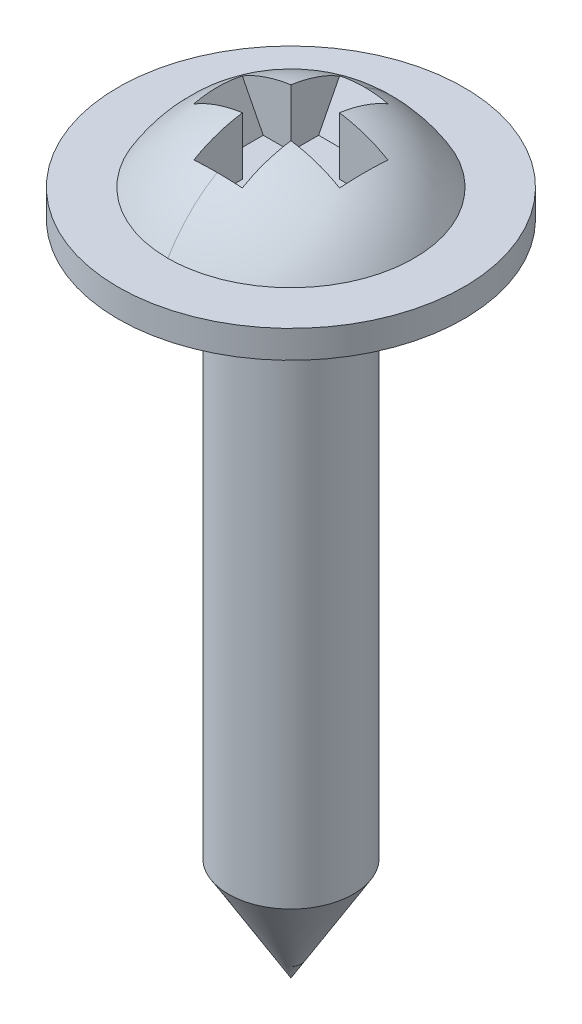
ISO-10303-21;
HEADER;
FILE_DESCRIPTION(('STEP AP214'),'2;1');
FILE_NAME('part.step','',(''),(''),'','','');
FILE_SCHEMA(('AUTOMOTIVE_DESIGN { 1 0 10303 214 1 1 1 1 }'));
ENDSEC;
DATA;
#1=APPLICATION_CONTEXT('core data for automotive mechanical design processes');
#2=APPLICATION_PROTOCOL_DEFINITION('international standard','automotive_design',2000,#1);
#3=PRODUCT_CONTEXT('',#1,'mechanical');
#4=PRODUCT('Part','Part','',(#3));
#5=PRODUCT_RELATED_PRODUCT_CATEGORY('part','',(#4));
#6=PRODUCT_DEFINITION_FORMATION('','',#4);
#7=PRODUCT_DEFINITION_CONTEXT('part definition',#1,'design');
#8=PRODUCT_DEFINITION('design','',#6,#7);
#9=PRODUCT_DEFINITION_SHAPE('','',#8);
#10=(LENGTH_UNIT() NAMED_UNIT(*) SI_UNIT(.MILLI.,.METRE.));
#11=(NAMED_UNIT(*) PLANE_ANGLE_UNIT() SI_UNIT($,.RADIAN.));
#12=(NAMED_UNIT(*) SI_UNIT($,.STERADIAN.) SOLID_ANGLE_UNIT());
#13=UNCERTAINTY_MEASURE_WITH_UNIT(LENGTH_MEASURE(1.E-05),#10,'distance_accuracy_value','');
#14=(GEOMETRIC_REPRESENTATION_CONTEXT(3) GLOBAL_UNCERTAINTY_ASSIGNED_CONTEXT((#13)) GLOBAL_UNIT_ASSIGNED_CONTEXT((#10,
#11,#12)) REPRESENTATION_CONTEXT('',''));
#15=CARTESIAN_POINT('',(0.,0.,0.));
#16=DIRECTION('',(0.,0.,1.));
#17=DIRECTION('',(1.,0.,0.));
#18=AXIS2_PLACEMENT_3D('',#15,#16,#17);
#19=CARTESIAN_POINT('',(-0.75,0.5,-0.35));
#20=DIRECTION('',(0.,-1.,0.));
#21=DIRECTION('',(0.,0.,-1.));
#22=AXIS2_PLACEMENT_3D('',#19,#20,#21);
#23=PLANE('',#22);
#24=DIRECTION('',(0.,0.,-1.));
#25=VECTOR('',#24,1.);
#26=CARTESIAN_POINT('',(0.35,0.5,0.));
#27=LINE('',#26,#25);
#28=CARTESIAN_POINT('',(0.349999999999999,0.5,-0.35));
#29=VERTEX_POINT('',#28);
#30=CARTESIAN_POINT('',(0.349999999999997,0.5,-0.750000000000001));
#31=VERTEX_POINT('',#30);
#32=EDGE_CURVE('E293',#29,#31,#27,.T.);
#33=ORIENTED_EDGE('',*,*,#32,.T.);
#34=DIRECTION('',(1.,0.,0.));
#35=VECTOR('',#34,1.);
#36=CARTESIAN_POINT('',(-0.350000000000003,0.500000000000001,-0.749999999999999));
#37=LINE('',#36,#35);
#38=CARTESIAN_POINT('',(-0.350000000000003,0.500000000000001,-0.749999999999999));
#39=VERTEX_POINT('',#38);
#40=EDGE_CURVE('E304',#31,#39,#37,.F.);
#41=ORIENTED_EDGE('',*,*,#40,.T.);
#42=DIRECTION('',(0.,0.,-1.));
#43=VECTOR('',#42,1.);
#44=CARTESIAN_POINT('',(-0.35,0.5,0.));
#45=LINE('',#44,#43);
#46=CARTESIAN_POINT('',(-0.350000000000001,0.5,-0.35));
#47=VERTEX_POINT('',#46);
#48=EDGE_CURVE('E328',#47,#39,#45,.T.);
#49=ORIENTED_EDGE('',*,*,#48,.F.);
#50=DIRECTION('',(1.,0.,0.));
#51=VECTOR('',#50,1.);
#52=CARTESIAN_POINT('',(0.,0.5,-0.35));
#53=LINE('',#52,#51);
#54=CARTESIAN_POINT('',(-0.75,0.5,-0.35));
#55=VERTEX_POINT('',#54);
#56=EDGE_CURVE('E323',#55,#47,#53,.T.);
#57=ORIENTED_EDGE('',*,*,#56,.F.);
#58=DIRECTION('',(0.,0.,1.));
#59=VECTOR('',#58,1.);
#60=CARTESIAN_POINT('',(-0.75,0.5,-0.35));
#61=LINE('',#60,#59);
#62=CARTESIAN_POINT('',(-0.75,0.5,0.35));
#63=VERTEX_POINT('',#62);
#64=EDGE_CURVE('E318',#55,#63,#61,.T.);
#65=ORIENTED_EDGE('',*,*,#64,.T.);
#66=DIRECTION('',(1.,0.,0.));
#67=VECTOR('',#66,1.);
#68=CARTESIAN_POINT('',(0.,0.5,0.35));
#69=LINE('',#68,#67);
#70=CARTESIAN_POINT('',(-0.349999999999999,0.5,0.35));
#71=VERTEX_POINT('',#70);
#72=EDGE_CURVE('E310',#63,#71,#69,.T.);
#73=ORIENTED_EDGE('',*,*,#72,.T.);
#74=DIRECTION('',(0.,0.,-1.));
#75=VECTOR('',#74,1.);
#76=CARTESIAN_POINT('',(-0.35,0.5,0.));
#77=LINE('',#76,#75);
#78=CARTESIAN_POINT('',(-0.349999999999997,0.5,0.750000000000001));
#79=VERTEX_POINT('',#78);
#80=EDGE_CURVE('E307',#79,#71,#77,.T.);
#81=ORIENTED_EDGE('',*,*,#80,.F.);
#82=DIRECTION('',(1.,0.,0.));
#83=VECTOR('',#82,1.);
#84=CARTESIAN_POINT('',(-0.349999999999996,0.5,0.750000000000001));
#85=LINE('',#84,#83);
#86=CARTESIAN_POINT('',(0.350000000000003,0.500000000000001,0.749999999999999));
#87=VERTEX_POINT('',#86);
#88=EDGE_CURVE('E301',#79,#87,#85,.T.);
#89=ORIENTED_EDGE('',*,*,#88,.T.);
#90=DIRECTION('',(0.,0.,-1.));
#91=VECTOR('',#90,1.);
#92=CARTESIAN_POINT('',(0.35,0.5,0.));
#93=LINE('',#92,#91);
#94=CARTESIAN_POINT('',(0.350000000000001,0.5,0.35));
#95=VERTEX_POINT('',#94);
#96=EDGE_CURVE('E289',#87,#95,#93,.T.);
#97=ORIENTED_EDGE('',*,*,#96,.T.);
#98=DIRECTION('',(1.,0.,0.));
#99=VECTOR('',#98,1.);
#100=CARTESIAN_POINT('',(0.,0.5,0.35));
#101=LINE('',#100,#99);
#102=CARTESIAN_POINT('',(0.75,0.5,0.35));
#103=VERTEX_POINT('',#102);
#104=EDGE_CURVE('E286',#95,#103,#101,.T.);
#105=ORIENTED_EDGE('',*,*,#104,.T.);
#106=DIRECTION('',(0.,0.,1.));
#107=VECTOR('',#106,1.);
#108=CARTESIAN_POINT('',(0.75,0.5,-0.35));
#109=LINE('',#108,#107);
#110=CARTESIAN_POINT('',(0.75,0.5,-0.35));
#111=VERTEX_POINT('',#110);
#112=EDGE_CURVE('E278',#103,#111,#109,.F.);
#113=ORIENTED_EDGE('',*,*,#112,.T.);
#114=DIRECTION('',(1.,0.,0.));
#115=VECTOR('',#114,1.);
#116=CARTESIAN_POINT('',(0.,0.5,-0.35));
#117=LINE('',#116,#115);
#118=EDGE_CURVE('E275',#29,#111,#117,.T.);
#119=ORIENTED_EDGE('',*,*,#118,.F.);
#120=EDGE_LOOP('',(#33,#41,#49,#57,#65,#73,#81,#89,#97,#105,#113,#119));
#121=FACE_BOUND('',#120,.T.);
#122=ADVANCED_FACE('F14',(#121),#23,.F.);
#123=CARTESIAN_POINT('',(0.35,0.,0.));
#124=DIRECTION('',(1.,0.,0.));
#125=DIRECTION('',(0.,0.,-1.));
#126=AXIS2_PLACEMENT_3D('',#123,#124,#125);
#127=PLANE('',#126);
#128=DIRECTION('',(0.,0.889836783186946,-0.456278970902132));
#129=VECTOR('',#128,1.);
#130=CARTESIAN_POINT('',(0.349999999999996,0.499999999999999,-0.750000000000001));
#131=LINE('',#130,#129);
#132=CARTESIAN_POINT('',(0.349999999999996,1.09190233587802,-1.0535080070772));
#133=VERTEX_POINT('',#132);
#134=EDGE_CURVE('E124',#133,#31,#131,.F.);
#135=ORIENTED_EDGE('',*,*,#134,.T.);
#136=ORIENTED_EDGE('',*,*,#32,.F.);
#137=DIRECTION('',(0.,1.,0.));
#138=VECTOR('',#137,1.);
#139=CARTESIAN_POINT('',(0.349999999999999,0.,-0.35));
#140=LINE('',#139,#138);
#141=CARTESIAN_POINT('',(0.349999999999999,1.3319267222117,-0.35));
#142=VERTEX_POINT('',#141);
#143=EDGE_CURVE('E279',#142,#29,#140,.F.);
#144=ORIENTED_EDGE('',*,*,#143,.F.);
#145=CARTESIAN_POINT('',(0.349999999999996,1.09190233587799,-1.05350800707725));
#146=CARTESIAN_POINT('',(0.349999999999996,1.10772814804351,-1.02635544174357));
#147=CARTESIAN_POINT('',(0.349999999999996,1.12283813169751,-0.998787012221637));
#148=CARTESIAN_POINT('',(0.349999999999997,1.15150266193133,-0.943103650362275));
#149=CARTESIAN_POINT('',(0.349999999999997,1.1650676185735,-0.914994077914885));
#150=CARTESIAN_POINT('',(0.349999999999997,1.19068784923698,-0.858250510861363));
#151=CARTESIAN_POINT('',(0.349999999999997,1.20274974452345,-0.829619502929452));
#152=CARTESIAN_POINT('',(0.349999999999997,1.22541219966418,-0.771855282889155));
#153=CARTESIAN_POINT('',(0.349999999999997,1.23601579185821,-0.742723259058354));
#154=CARTESIAN_POINT('',(0.349999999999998,1.25580007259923,-0.683997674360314));
#155=CARTESIAN_POINT('',(0.349999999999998,1.26498149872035,-0.654404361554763));
#156=CARTESIAN_POINT('',(0.349999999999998,1.28197609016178,-0.594747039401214));
#157=CARTESIAN_POINT('',(0.349999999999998,1.28978572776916,-0.564682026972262));
#158=CARTESIAN_POINT('',(0.349999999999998,1.3040780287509,-0.504091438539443));
#159=CARTESIAN_POINT('',(0.349999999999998,1.31055433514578,-0.473564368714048));
#160=CARTESIAN_POINT('',(0.349999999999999,1.32221812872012,-0.412056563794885));
#161=CARTESIAN_POINT('',(0.349999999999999,1.32739686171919,-0.381074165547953));
#162=CARTESIAN_POINT('',(0.349999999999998,1.3319267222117,-0.350000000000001));
#163=B_SPLINE_CURVE_WITH_KNOTS('',3,(#145,#146,#147,#148,#149,#150,#151,#152,#153,#154,#155,
#156,#157,#158,#159,#160,#161,#162),.UNSPECIFIED.,.F.,.F.,(4,2,2,2,2,2,2,2,4),(0.,
0.0942713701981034,0.187864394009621,0.281029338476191,0.37399753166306,0.466917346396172,
0.560072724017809,0.653662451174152,0.747867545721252),.UNSPECIFIED.);
#164=EDGE_CURVE('E128',#133,#142,#163,.T.);
#165=ORIENTED_EDGE('',*,*,#164,.F.);
#166=EDGE_LOOP('',(#135,#136,#144,#165));
#167=FACE_BOUND('',#166,.T.);
#168=ADVANCED_FACE('F416',(#167),#127,.F.);
#169=CARTESIAN_POINT('',(0.,0.,-0.35));
#170=DIRECTION('',(0.,0.,1.));
#171=DIRECTION('',(1.,0.,0.));
#172=AXIS2_PLACEMENT_3D('',#169,#170,#171);
#173=PLANE('',#172);
#174=DIRECTION('',(0.456278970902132,0.889836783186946,0.));
#175=VECTOR('',#174,1.);
#176=CARTESIAN_POINT('',(0.75,0.5,-0.35));
#177=LINE('',#176,#175);
#178=CARTESIAN_POINT('',(1.05350800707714,1.09190233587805,-0.35));
#179=VERTEX_POINT('',#178);
#180=EDGE_CURVE('E283',#111,#179,#177,.T.);
#181=ORIENTED_EDGE('',*,*,#180,.T.);
#182=CARTESIAN_POINT('',(0.35,1.3319267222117,-0.35));
#183=CARTESIAN_POINT('',(0.381074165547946,1.32739686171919,-0.35));
#184=CARTESIAN_POINT('',(0.412056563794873,1.32221812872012,-0.35));
#185=CARTESIAN_POINT('',(0.473564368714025,1.31055433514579,-0.35));
#186=CARTESIAN_POINT('',(0.504091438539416,1.3040780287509,-0.35));
#187=CARTESIAN_POINT('',(0.564682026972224,1.28978572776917,-0.35));
#188=CARTESIAN_POINT('',(0.594747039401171,1.28197609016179,-0.35));
#189=CARTESIAN_POINT('',(0.65440436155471,1.26498149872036,-0.35));
#190=CARTESIAN_POINT('',(0.683997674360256,1.25580007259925,-0.35));
#191=CARTESIAN_POINT('',(0.742723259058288,1.23601579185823,-0.35));
#192=CARTESIAN_POINT('',(0.771855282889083,1.22541219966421,-0.35));
#193=CARTESIAN_POINT('',(0.829619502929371,1.20274974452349,-0.35));
#194=CARTESIAN_POINT('',(0.858250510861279,1.19068784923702,-0.35));
#195=CARTESIAN_POINT('',(0.914994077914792,1.16506761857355,-0.35));
#196=CARTESIAN_POINT('',(0.943103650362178,1.15150266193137,-0.35));
#197=CARTESIAN_POINT('',(0.998787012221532,1.12283813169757,-0.35));
#198=CARTESIAN_POINT('',(1.02635544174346,1.10772814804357,-0.35));
#199=CARTESIAN_POINT('',(1.05350800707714,1.09190233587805,-0.35));
#200=B_SPLINE_CURVE_WITH_KNOTS('',3,(#182,#183,#184,#185,#186,#187,#188,#189,#190,#191,#192,
#193,#194,#195,#196,#197,#198,#199),.UNSPECIFIED.,.F.,.F.,(4,2,2,2,2,2,2,2,4),(0.,
0.0942050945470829,0.187794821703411,0.280950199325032,0.373870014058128,0.466838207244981,
0.560003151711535,0.653596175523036,0.747867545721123),.UNSPECIFIED.);
#201=EDGE_CURVE('E419',#142,#179,#200,.T.);
#202=ORIENTED_EDGE('',*,*,#201,.F.);
#203=ORIENTED_EDGE('',*,*,#143,.T.);
#204=ORIENTED_EDGE('',*,*,#118,.T.);
#205=EDGE_LOOP('',(#181,#202,#203,#204));
#206=FACE_BOUND('',#205,.T.);
#207=ADVANCED_FACE('F432',(#206),#173,.T.);
#208=CARTESIAN_POINT('',(0.75,0.5,-0.35));
#209=DIRECTION('',(0.889836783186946,-0.456278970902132,0.));
#210=DIRECTION('',(0.456278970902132,0.889836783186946,0.));
#211=AXIS2_PLACEMENT_3D('',#208,#209,#210);
#212=PLANE('',#211);
#213=ORIENTED_EDGE('',*,*,#180,.F.);
#214=ORIENTED_EDGE('',*,*,#112,.F.);
#215=DIRECTION('',(0.456278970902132,0.889836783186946,0.));
#216=VECTOR('',#215,1.);
#217=CARTESIAN_POINT('',(0.75,0.5,0.35));
#218=LINE('',#217,#216);
#219=CARTESIAN_POINT('',(1.05350800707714,1.09190233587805,0.35));
#220=VERTEX_POINT('',#219);
#221=EDGE_CURVE('E290',#103,#220,#218,.T.);
#222=ORIENTED_EDGE('',*,*,#221,.T.);
#223=CARTESIAN_POINT('',(1.05350800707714,1.09190233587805,-0.35));
#224=CARTESIAN_POINT('',(1.0557298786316,1.09623543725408,-0.320929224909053));
#225=CARTESIAN_POINT('',(1.05767113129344,1.10002127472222,-0.291755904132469));
#226=CARTESIAN_POINT('',(1.06098527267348,1.10648452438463,-0.233406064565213));
#227=CARTESIAN_POINT('',(1.06236101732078,1.10916750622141,-0.204230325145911));
#228=CARTESIAN_POINT('',(1.06455597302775,1.11344811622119,-0.145878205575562));
#229=CARTESIAN_POINT('',(1.06537705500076,1.11504939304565,-0.11670216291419));
#230=CARTESIAN_POINT('',(1.06647015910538,1.11718116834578,-0.0583506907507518));
#231=CARTESIAN_POINT('',(1.06674311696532,1.117713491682,-0.0291753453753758));
#232=CARTESIAN_POINT('',(1.06674311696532,1.117713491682,0.0291753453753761));
#233=CARTESIAN_POINT('',(1.06647015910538,1.11718116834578,0.058350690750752));
#234=CARTESIAN_POINT('',(1.06537705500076,1.11504939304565,0.11670216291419));
#235=CARTESIAN_POINT('',(1.06455597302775,1.11344811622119,0.145878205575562));
#236=CARTESIAN_POINT('',(1.06236101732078,1.10916750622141,0.204230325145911));
#237=CARTESIAN_POINT('',(1.06098527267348,1.10648452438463,0.233406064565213));
#238=CARTESIAN_POINT('',(1.05767113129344,1.10002127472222,0.29175590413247));
#239=CARTESIAN_POINT('',(1.0557298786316,1.09623543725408,0.320929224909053));
#240=CARTESIAN_POINT('',(1.05350800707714,1.09190233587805,0.35));
#241=B_SPLINE_CURVE_WITH_KNOTS('',3,(#223,#224,#225,#226,#227,#228,#229,#230,#231,#232,#233,
#234,#235,#236,#237,#238,#239,#240),.UNSPECIFIED.,.F.,.F.,(4,2,2,2,2,2,2,2,4),(0.,
0.0884201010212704,0.176388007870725,0.264057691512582,0.351577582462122,0.439097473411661,
0.526767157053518,0.614735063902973,0.703155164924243),.UNSPECIFIED.);
#242=EDGE_CURVE('E420',#179,#220,#241,.T.);
#243=ORIENTED_EDGE('',*,*,#242,.F.);
#244=EDGE_LOOP('',(#213,#214,#222,#243));
#245=FACE_BOUND('',#244,.T.);
#246=ADVANCED_FACE('F436',(#245),#212,.F.);
#247=CARTESIAN_POINT('',(0.,0.,0.35));
#248=DIRECTION('',(0.,0.,1.));
#249=DIRECTION('',(1.,0.,0.));
#250=AXIS2_PLACEMENT_3D('',#247,#248,#249);
#251=PLANE('',#250);
#252=DIRECTION('',(0.,1.,0.));
#253=VECTOR('',#252,1.);
#254=CARTESIAN_POINT('',(0.350000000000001,0.,0.35));
#255=LINE('',#254,#253);
#256=CARTESIAN_POINT('',(0.350000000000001,1.3319267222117,0.350000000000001));
#257=VERTEX_POINT('',#256);
#258=EDGE_CURVE('E298',#95,#257,#255,.T.);
#259=ORIENTED_EDGE('',*,*,#258,.T.);
#260=CARTESIAN_POINT('',(1.05350800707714,1.09190233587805,0.35));
#261=CARTESIAN_POINT('',(1.02635544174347,1.10772814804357,0.35));
#262=CARTESIAN_POINT('',(0.998787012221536,1.12283813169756,0.35));
#263=CARTESIAN_POINT('',(0.943103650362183,1.15150266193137,0.35));
#264=CARTESIAN_POINT('',(0.914994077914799,1.16506761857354,0.35));
#265=CARTESIAN_POINT('',(0.858250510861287,1.19068784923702,0.35));
#266=CARTESIAN_POINT('',(0.829619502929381,1.20274974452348,0.35));
#267=CARTESIAN_POINT('',(0.771855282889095,1.22541219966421,0.35));
#268=CARTESIAN_POINT('',(0.7427232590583,1.23601579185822,0.35));
#269=CARTESIAN_POINT('',(0.683997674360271,1.25580007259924,0.35));
#270=CARTESIAN_POINT('',(0.654404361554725,1.26498149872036,0.35));
#271=CARTESIAN_POINT('',(0.594747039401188,1.28197609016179,0.35));
#272=CARTESIAN_POINT('',(0.564682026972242,1.28978572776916,0.35));
#273=CARTESIAN_POINT('',(0.504091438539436,1.3040780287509,0.35));
#274=CARTESIAN_POINT('',(0.473564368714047,1.31055433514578,0.35));
#275=CARTESIAN_POINT('',(0.412056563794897,1.32221812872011,0.35));
#276=CARTESIAN_POINT('',(0.381074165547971,1.32739686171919,0.35));
#277=CARTESIAN_POINT('',(0.350000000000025,1.3319267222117,0.35));
#278=B_SPLINE_CURVE_WITH_KNOTS('',3,(#260,#261,#262,#263,#264,#265,#266,#267,#268,#269,#270,
#271,#272,#273,#274,#275,#276,#277),.UNSPECIFIED.,.F.,.F.,(4,2,2,2,2,2,2,2,4),(0.,
0.0942713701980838,0.187864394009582,0.281029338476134,0.373997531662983,0.466917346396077,
0.560072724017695,0.653662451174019,0.747867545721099),.UNSPECIFIED.);
#279=EDGE_CURVE('E449',#220,#257,#278,.T.);
#280=ORIENTED_EDGE('',*,*,#279,.F.);
#281=ORIENTED_EDGE('',*,*,#221,.F.);
#282=ORIENTED_EDGE('',*,*,#104,.F.);
#283=EDGE_LOOP('',(#259,#280,#281,#282));
#284=FACE_BOUND('',#283,.T.);
#285=ADVANCED_FACE('F441',(#284),#251,.F.);
#286=CARTESIAN_POINT('',(0.35,0.,0.));
#287=DIRECTION('',(1.,0.,0.));
#288=DIRECTION('',(0.,0.,-1.));
#289=AXIS2_PLACEMENT_3D('',#286,#287,#288);
#290=PLANE('',#289);
#291=ORIENTED_EDGE('',*,*,#258,.F.);
#292=ORIENTED_EDGE('',*,*,#96,.F.);
#293=DIRECTION('',(0.,-0.889836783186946,-0.456278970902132));
#294=VECTOR('',#293,1.);
#295=CARTESIAN_POINT('',(0.350000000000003,1.47510168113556,1.25));
#296=LINE('',#295,#294);
#297=CARTESIAN_POINT('',(0.350000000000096,1.09190233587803,1.05350800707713));
#298=VERTEX_POINT('',#297);
#299=EDGE_CURVE('E303',#87,#298,#296,.F.);
#300=ORIENTED_EDGE('',*,*,#299,.T.);
#301=CARTESIAN_POINT('',(0.350000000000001,1.3319267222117,0.350000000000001));
#302=CARTESIAN_POINT('',(0.350000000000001,1.32739686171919,0.381074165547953));
#303=CARTESIAN_POINT('',(0.350000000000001,1.32221812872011,0.412056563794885));
#304=CARTESIAN_POINT('',(0.350000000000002,1.31055433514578,0.473564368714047));
#305=CARTESIAN_POINT('',(0.350000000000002,1.3040780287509,0.504091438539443));
#306=CARTESIAN_POINT('',(0.350000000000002,1.28978572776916,0.564682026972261));
#307=CARTESIAN_POINT('',(0.350000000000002,1.28197609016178,0.594747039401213));
#308=CARTESIAN_POINT('',(0.350000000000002,1.26498149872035,0.654404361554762));
#309=CARTESIAN_POINT('',(0.350000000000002,1.25580007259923,0.683997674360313));
#310=CARTESIAN_POINT('',(0.350000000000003,1.23601579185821,0.742723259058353));
#311=CARTESIAN_POINT('',(0.350000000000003,1.22541219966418,0.771855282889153));
#312=CARTESIAN_POINT('',(0.350000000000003,1.20274974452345,0.829619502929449));
#313=CARTESIAN_POINT('',(0.350000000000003,1.19068784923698,0.858250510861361));
#314=CARTESIAN_POINT('',(0.350000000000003,1.1650676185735,0.914994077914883));
#315=CARTESIAN_POINT('',(0.350000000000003,1.15150266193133,0.943103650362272));
#316=CARTESIAN_POINT('',(0.350000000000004,1.12283813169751,0.998787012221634));
#317=CARTESIAN_POINT('',(0.350000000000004,1.10772814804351,1.02635544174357));
#318=CARTESIAN_POINT('',(0.350000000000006,1.09190233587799,1.05350800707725));
#319=B_SPLINE_CURVE_WITH_KNOTS('',3,(#301,#302,#303,#304,#305,#306,#307,#308,#309,#310,#311,
#312,#313,#314,#315,#316,#317,#318),.UNSPECIFIED.,.F.,.F.,(4,2,2,2,2,2,2,2,4),(0.,
0.0942050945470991,0.187794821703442,0.280950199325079,0.373870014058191,0.466838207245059,
0.560003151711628,0.653596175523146,0.747867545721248),.UNSPECIFIED.);
#320=EDGE_CURVE('E147',#257,#298,#319,.T.);
#321=ORIENTED_EDGE('',*,*,#320,.F.);
#322=EDGE_LOOP('',(#291,#292,#300,#321));
#323=FACE_BOUND('',#322,.T.);
#324=ADVANCED_FACE('F240',(#323),#290,.F.);
#325=CARTESIAN_POINT('',(-0.350000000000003,0.5,-0.749999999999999));
#326=DIRECTION('',(0.,-0.456278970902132,-0.889836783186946));
#327=DIRECTION('',(0.,0.889836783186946,-0.456278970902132));
#328=AXIS2_PLACEMENT_3D('',#325,#326,#327);
#329=PLANE('',#328);
#330=CARTESIAN_POINT('',(-0.350000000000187,1.09190233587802,-1.05350800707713));
#331=CARTESIAN_POINT('',(-0.292067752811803,1.10051064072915,-1.05792206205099));
#332=CARTESIAN_POINT('',(-0.233934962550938,1.10696572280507,-1.0612320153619));
#333=CARTESIAN_POINT('',(-0.117268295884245,1.11556944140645,-1.06564371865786));
#334=CARTESIAN_POINT('',(-0.0587344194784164,1.11771807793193,-1.06674546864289));
#335=CARTESIAN_POINT('',(-1.06038106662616E-13,1.11771349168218,-1.06674311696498));
#336=B_SPLINE_CURVE_WITH_KNOTS('',3,(#330,#331,#332,#333,#334,#335),.UNSPECIFIED.,.F.,.F.,(4,2,
4),(0.,0.175750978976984,0.351501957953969),.UNSPECIFIED.);
#337=CARTESIAN_POINT('',(-0.350000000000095,1.09190233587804,-1.05350800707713));
#338=VERTEX_POINT('',#337);
#339=CARTESIAN_POINT('',(1.00798073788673E-13,1.117713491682,-1.06674311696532));
#340=VERTEX_POINT('',#339);
#341=EDGE_CURVE('E120',#338,#340,#336,.T.);
#342=ORIENTED_EDGE('',*,*,#341,.F.);
#343=DIRECTION('',(0.,0.889836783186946,-0.456278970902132));
#344=VECTOR('',#343,1.);
#345=CARTESIAN_POINT('',(-0.350000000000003,0.5,-0.749999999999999));
#346=LINE('',#345,#344);
#347=EDGE_CURVE('E129',#39,#338,#346,.T.);
#348=ORIENTED_EDGE('',*,*,#347,.F.);
#349=ORIENTED_EDGE('',*,*,#40,.F.);
#350=ORIENTED_EDGE('',*,*,#134,.F.);
#351=CARTESIAN_POINT('',(0.,1.117713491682,-1.06674311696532));
#352=CARTESIAN_POINT('',(0.0587344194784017,1.11771807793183,-1.06674546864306));
#353=CARTESIAN_POINT('',(0.117268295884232,1.11556944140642,-1.06564371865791));
#354=CARTESIAN_POINT('',(0.233934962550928,1.1069657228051,-1.06123201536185));
#355=CARTESIAN_POINT('',(0.292067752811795,1.10051064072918,-1.05792206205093));
#356=CARTESIAN_POINT('',(0.350000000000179,1.09190233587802,-1.05350800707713));
#357=B_SPLINE_CURVE_WITH_KNOTS('',3,(#351,#352,#353,#354,#355,#356),.UNSPECIFIED.,.F.,.F.,(4,2,
4),(0.,0.175750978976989,0.351501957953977),.UNSPECIFIED.);
#358=EDGE_CURVE('E17',#340,#133,#357,.T.);
#359=ORIENTED_EDGE('',*,*,#358,.F.);
#360=EDGE_LOOP('',(#342,#348,#349,#350,#359));
#361=FACE_BOUND('',#360,.T.);
#362=ADVANCED_FACE('F117',(#361),#329,.F.);
#363=CARTESIAN_POINT('',(-0.349999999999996,1.47510168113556,1.25));
#364=DIRECTION('',(0.,-0.456278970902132,0.889836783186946));
#365=DIRECTION('',(0.,-0.889836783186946,-0.456278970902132));
#366=AXIS2_PLACEMENT_3D('',#363,#364,#365);
#367=PLANE('',#366);
#368=CARTESIAN_POINT('',(0.350000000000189,1.09190233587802,1.05350800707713));
#369=CARTESIAN_POINT('',(0.292067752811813,1.10051064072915,1.05792206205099));
#370=CARTESIAN_POINT('',(0.233934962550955,1.10696572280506,1.0612320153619));
#371=CARTESIAN_POINT('',(0.117268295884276,1.11556944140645,1.06564371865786));
#372=CARTESIAN_POINT('',(0.0587344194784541,1.11771807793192,1.06674546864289));
#373=CARTESIAN_POINT('',(1.5085665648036E-13,1.11771349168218,1.06674311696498));
#374=B_SPLINE_CURVE_WITH_KNOTS('',3,(#368,#369,#370,#371,#372,#373),.UNSPECIFIED.,.F.,.F.,(4,2,
4),(0.,0.175750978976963,0.351501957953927),.UNSPECIFIED.);
#375=CARTESIAN_POINT('',(0.,1.11771349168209,1.06674311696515));
#376=VERTEX_POINT('',#375);
#377=EDGE_CURVE('E145',#298,#376,#374,.T.);
#378=ORIENTED_EDGE('',*,*,#377,.F.);
#379=ORIENTED_EDGE('',*,*,#299,.F.);
#380=ORIENTED_EDGE('',*,*,#88,.F.);
#381=DIRECTION('',(0.,-0.889836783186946,-0.456278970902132));
#382=VECTOR('',#381,1.);
#383=CARTESIAN_POINT('',(-0.349999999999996,1.09190233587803,1.05350800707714));
#384=LINE('',#383,#382);
#385=CARTESIAN_POINT('',(-0.349999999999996,1.09190233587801,1.05350800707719));
#386=VERTEX_POINT('',#385);
#387=EDGE_CURVE('E311',#386,#79,#384,.T.);
#388=ORIENTED_EDGE('',*,*,#387,.F.);
#389=CARTESIAN_POINT('',(0.,1.117713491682,1.06674311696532));
#390=CARTESIAN_POINT('',(-0.0587344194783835,1.11771807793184,1.06674546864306));
#391=CARTESIAN_POINT('',(-0.117268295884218,1.11556944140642,1.06564371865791));
#392=CARTESIAN_POINT('',(-0.233934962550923,1.1069657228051,1.06123201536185));
#393=CARTESIAN_POINT('',(-0.292067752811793,1.10051064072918,1.05792206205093));
#394=CARTESIAN_POINT('',(-0.350000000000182,1.09190233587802,1.05350800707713));
#395=B_SPLINE_CURVE_WITH_KNOTS('',3,(#389,#390,#391,#392,#393,#394),.UNSPECIFIED.,.F.,.F.,(4,2,
4),(0.,0.175750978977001,0.351501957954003),.UNSPECIFIED.);
#396=EDGE_CURVE('E154',#376,#386,#395,.T.);
#397=ORIENTED_EDGE('',*,*,#396,.F.);
#398=EDGE_LOOP('',(#378,#379,#380,#388,#397));
#399=FACE_BOUND('',#398,.T.);
#400=ADVANCED_FACE('F229',(#399),#367,.F.);
#401=CARTESIAN_POINT('',(-0.35,0.,0.));
#402=DIRECTION('',(1.,0.,0.));
#403=DIRECTION('',(0.,0.,-1.));
#404=AXIS2_PLACEMENT_3D('',#401,#402,#403);
#405=PLANE('',#404);
#406=DIRECTION('',(0.,1.,0.));
#407=VECTOR('',#406,1.);
#408=CARTESIAN_POINT('',(-0.349999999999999,0.,0.35));
#409=LINE('',#408,#407);
#410=CARTESIAN_POINT('',(-0.350000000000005,1.33192672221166,0.35));
#411=VERTEX_POINT('',#410);
#412=EDGE_CURVE('E315',#71,#411,#409,.T.);
#413=ORIENTED_EDGE('',*,*,#412,.T.);
#414=CARTESIAN_POINT('',(-0.349999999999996,1.09190233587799,1.05350800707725));
#415=CARTESIAN_POINT('',(-0.349999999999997,1.10772814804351,1.02635544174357));
#416=CARTESIAN_POINT('',(-0.349999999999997,1.12283813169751,0.998787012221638));
#417=CARTESIAN_POINT('',(-0.349999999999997,1.15150266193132,0.943103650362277));
#418=CARTESIAN_POINT('',(-0.349999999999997,1.1650676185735,0.914994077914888));
#419=CARTESIAN_POINT('',(-0.349999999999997,1.19068784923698,0.858250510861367));
#420=CARTESIAN_POINT('',(-0.349999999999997,1.20274974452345,0.829619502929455));
#421=CARTESIAN_POINT('',(-0.349999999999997,1.22541219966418,0.771855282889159));
#422=CARTESIAN_POINT('',(-0.349999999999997,1.2360157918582,0.74272325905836));
#423=CARTESIAN_POINT('',(-0.349999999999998,1.25580007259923,0.68399767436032));
#424=CARTESIAN_POINT('',(-0.349999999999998,1.26498149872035,0.654404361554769));
#425=CARTESIAN_POINT('',(-0.349999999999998,1.28197609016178,0.594747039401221));
#426=CARTESIAN_POINT('',(-0.349999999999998,1.28978572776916,0.56468202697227));
#427=CARTESIAN_POINT('',(-0.349999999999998,1.30407802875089,0.504091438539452));
#428=CARTESIAN_POINT('',(-0.349999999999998,1.31055433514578,0.473564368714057));
#429=CARTESIAN_POINT('',(-0.349999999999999,1.32221812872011,0.412056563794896));
#430=CARTESIAN_POINT('',(-0.349999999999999,1.32739686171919,0.381074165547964));
#431=CARTESIAN_POINT('',(-0.349999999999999,1.3319267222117,0.350000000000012));
#432=B_SPLINE_CURVE_WITH_KNOTS('',3,(#414,#415,#416,#417,#418,#419,#420,#421,#422,#423,#424,
#425,#426,#427,#428,#429,#430,#431),.UNSPECIFIED.,.F.,.F.,(4,2,2,2,2,2,2,2,4),(0.,
0.094271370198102,0.187864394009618,0.281029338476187,0.373997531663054,0.466917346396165,
0.5600727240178,0.653662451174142,0.74786754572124),.UNSPECIFIED.);
#433=EDGE_CURVE('E219',#386,#411,#432,.T.);
#434=ORIENTED_EDGE('',*,*,#433,.F.);
#435=ORIENTED_EDGE('',*,*,#387,.T.);
#436=ORIENTED_EDGE('',*,*,#80,.T.);
#437=EDGE_LOOP('',(#413,#434,#435,#436));
#438=FACE_BOUND('',#437,.T.);
#439=ADVANCED_FACE('F225',(#438),#405,.T.);
#440=CARTESIAN_POINT('',(0.,0.,0.35));
#441=DIRECTION('',(0.,0.,1.));
#442=DIRECTION('',(1.,0.,0.));
#443=AXIS2_PLACEMENT_3D('',#440,#441,#442);
#444=PLANE('',#443);
#445=ORIENTED_EDGE('',*,*,#72,.F.);
#446=DIRECTION('',(0.456278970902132,-0.889836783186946,0.));
#447=VECTOR('',#446,1.);
#448=CARTESIAN_POINT('',(-1.25,1.47510168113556,0.35));
#449=LINE('',#448,#447);
#450=CARTESIAN_POINT('',(-1.05350800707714,1.09190233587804,0.350000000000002));
#451=VERTEX_POINT('',#450);
#452=EDGE_CURVE('E320',#63,#451,#449,.F.);
#453=ORIENTED_EDGE('',*,*,#452,.T.);
#454=CARTESIAN_POINT('',(-0.350000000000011,1.3319267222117,0.35));
#455=CARTESIAN_POINT('',(-0.381074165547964,1.32739686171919,0.35));
#456=CARTESIAN_POINT('',(-0.412056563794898,1.32221812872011,0.35));
#457=CARTESIAN_POINT('',(-0.473564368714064,1.31055433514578,0.35));
#458=CARTESIAN_POINT('',(-0.504091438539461,1.30407802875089,0.35));
#459=CARTESIAN_POINT('',(-0.564682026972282,1.28978572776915,0.35));
#460=CARTESIAN_POINT('',(-0.594747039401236,1.28197609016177,0.35));
#461=CARTESIAN_POINT('',(-0.654404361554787,1.26498149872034,0.35));
#462=CARTESIAN_POINT('',(-0.68399767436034,1.25580007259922,0.35));
#463=CARTESIAN_POINT('',(-0.742723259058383,1.2360157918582,0.35));
#464=CARTESIAN_POINT('',(-0.771855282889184,1.22541219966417,0.35));
#465=CARTESIAN_POINT('',(-0.829619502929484,1.20274974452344,0.35));
#466=CARTESIAN_POINT('',(-0.858250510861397,1.19068784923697,0.35));
#467=CARTESIAN_POINT('',(-0.914994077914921,1.16506761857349,0.35));
#468=CARTESIAN_POINT('',(-0.943103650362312,1.15150266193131,0.35));
#469=CARTESIAN_POINT('',(-0.998787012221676,1.12283813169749,0.35));
#470=CARTESIAN_POINT('',(-1.02635544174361,1.10772814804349,0.35));
#471=CARTESIAN_POINT('',(-1.05350800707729,1.09190233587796,0.350000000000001));
#472=B_SPLINE_CURVE_WITH_KNOTS('',3,(#454,#455,#456,#457,#458,#459,#460,#461,#462,#463,#464,
#465,#466,#467,#468,#469,#470,#471),.UNSPECIFIED.,.F.,.F.,(4,2,2,2,2,2,2,2,4),(0.,
0.0942050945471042,0.187794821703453,0.280950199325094,0.373870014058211,0.466838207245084,
0.560003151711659,0.653596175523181,0.747867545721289),.UNSPECIFIED.);
#473=EDGE_CURVE('E214',#411,#451,#472,.T.);
#474=ORIENTED_EDGE('',*,*,#473,.F.);
#475=ORIENTED_EDGE('',*,*,#412,.F.);
#476=EDGE_LOOP('',(#445,#453,#474,#475));
#477=FACE_BOUND('',#476,.T.);
#478=ADVANCED_FACE('F228',(#477),#444,.F.);
#479=CARTESIAN_POINT('',(-1.25,1.47510168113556,-0.35));
#480=DIRECTION('',(-0.889836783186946,-0.456278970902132,0.));
#481=DIRECTION('',(0.456278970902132,-0.889836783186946,0.));
#482=AXIS2_PLACEMENT_3D('',#479,#480,#481);
#483=PLANE('',#482);
#484=ORIENTED_EDGE('',*,*,#452,.F.);
#485=ORIENTED_EDGE('',*,*,#64,.F.);
#486=DIRECTION('',(0.456278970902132,-0.889836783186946,0.));
#487=VECTOR('',#486,1.);
#488=CARTESIAN_POINT('',(-1.05350800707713,1.09190233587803,-0.35));
#489=LINE('',#488,#487);
#490=CARTESIAN_POINT('',(-1.05350800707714,1.09190233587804,-0.35));
#491=VERTEX_POINT('',#490);
#492=EDGE_CURVE('E325',#491,#55,#489,.T.);
#493=ORIENTED_EDGE('',*,*,#492,.F.);
#494=CARTESIAN_POINT('',(-1.05350800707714,1.09190233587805,0.350000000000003));
#495=CARTESIAN_POINT('',(-1.0557298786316,1.09623543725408,0.320929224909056));
#496=CARTESIAN_POINT('',(-1.05767113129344,1.10002127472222,0.291755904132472));
#497=CARTESIAN_POINT('',(-1.06098527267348,1.10648452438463,0.233406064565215));
#498=CARTESIAN_POINT('',(-1.06236101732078,1.10916750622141,0.204230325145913));
#499=CARTESIAN_POINT('',(-1.06455597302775,1.11344811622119,0.145878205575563));
#500=CARTESIAN_POINT('',(-1.06537705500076,1.11504939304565,0.116702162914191));
#501=CARTESIAN_POINT('',(-1.06647015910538,1.11718116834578,0.0583506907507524));
#502=CARTESIAN_POINT('',(-1.06674311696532,1.117713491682,0.0291753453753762));
#503=CARTESIAN_POINT('',(-1.06674311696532,1.117713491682,-0.0291753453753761));
#504=CARTESIAN_POINT('',(-1.06647015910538,1.11718116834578,-0.0583506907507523));
#505=CARTESIAN_POINT('',(-1.06537705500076,1.11504939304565,-0.116702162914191));
#506=CARTESIAN_POINT('',(-1.06455597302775,1.11344811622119,-0.145878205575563));
#507=CARTESIAN_POINT('',(-1.06236101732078,1.10916750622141,-0.204230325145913));
#508=CARTESIAN_POINT('',(-1.06098527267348,1.10648452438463,-0.233406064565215));
#509=CARTESIAN_POINT('',(-1.05767113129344,1.10002127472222,-0.291755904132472));
#510=CARTESIAN_POINT('',(-1.0557298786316,1.09623543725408,-0.320929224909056));
#511=CARTESIAN_POINT('',(-1.05350800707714,1.09190233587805,-0.350000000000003));
#512=B_SPLINE_CURVE_WITH_KNOTS('',3,(#494,#495,#496,#497,#498,#499,#500,#501,#502,#503,#504,
#505,#506,#507,#508,#509,#510,#511),.UNSPECIFIED.,.F.,.F.,(4,2,2,2,2,2,2,2,4),(0.,
0.0884201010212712,0.176388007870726,0.264057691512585,0.351577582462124,0.439097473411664,
0.526767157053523,0.614735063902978,0.703155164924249),.UNSPECIFIED.);
#513=EDGE_CURVE('E208',#451,#491,#512,.T.);
#514=ORIENTED_EDGE('',*,*,#513,.F.);
#515=EDGE_LOOP('',(#484,#485,#493,#514));
#516=FACE_BOUND('',#515,.T.);
#517=ADVANCED_FACE('F472',(#516),#483,.F.);
#518=CARTESIAN_POINT('',(0.,0.,-0.35));
#519=DIRECTION('',(0.,0.,1.));
#520=DIRECTION('',(1.,0.,0.));
#521=AXIS2_PLACEMENT_3D('',#518,#519,#520);
#522=PLANE('',#521);
#523=CARTESIAN_POINT('',(-1.05350800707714,1.09190233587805,-0.35));
#524=CARTESIAN_POINT('',(-1.02635544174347,1.10772814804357,-0.35));
#525=CARTESIAN_POINT('',(-0.998787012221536,1.12283813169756,-0.35));
#526=CARTESIAN_POINT('',(-0.943103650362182,1.15150266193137,-0.35));
#527=CARTESIAN_POINT('',(-0.914994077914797,1.16506761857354,-0.35));
#528=CARTESIAN_POINT('',(-0.858250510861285,1.19068784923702,-0.35));
#529=CARTESIAN_POINT('',(-0.829619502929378,1.20274974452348,-0.35));
#530=CARTESIAN_POINT('',(-0.771855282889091,1.22541219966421,-0.35));
#531=CARTESIAN_POINT('',(-0.742723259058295,1.23601579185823,-0.35));
#532=CARTESIAN_POINT('',(-0.683997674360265,1.25580007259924,-0.35));
#533=CARTESIAN_POINT('',(-0.654404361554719,1.26498149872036,-0.35));
#534=CARTESIAN_POINT('',(-0.594747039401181,1.28197609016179,-0.35));
#535=CARTESIAN_POINT('',(-0.564682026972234,1.28978572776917,-0.35));
#536=CARTESIAN_POINT('',(-0.504091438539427,1.3040780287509,-0.35));
#537=CARTESIAN_POINT('',(-0.473564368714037,1.31055433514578,-0.35));
#538=CARTESIAN_POINT('',(-0.412056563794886,1.32221812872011,-0.35));
#539=CARTESIAN_POINT('',(-0.381074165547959,1.32739686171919,-0.35));
#540=CARTESIAN_POINT('',(-0.350000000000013,1.3319267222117,-0.35));
#541=B_SPLINE_CURVE_WITH_KNOTS('',3,(#523,#524,#525,#526,#527,#528,#529,#530,#531,#532,#533,
#534,#535,#536,#537,#538,#539,#540),.UNSPECIFIED.,.F.,.F.,(4,2,2,2,2,2,2,2,4),(0.,
0.0942713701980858,0.187864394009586,0.281029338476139,0.37399753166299,0.466917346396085,
0.560072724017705,0.653662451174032,0.747867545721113),.UNSPECIFIED.);
#542=CARTESIAN_POINT('',(-0.350000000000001,1.33192672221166,-0.350000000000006));
#543=VERTEX_POINT('',#542);
#544=EDGE_CURVE('E201',#491,#543,#541,.T.);
#545=ORIENTED_EDGE('',*,*,#544,.F.);
#546=ORIENTED_EDGE('',*,*,#492,.T.);
#547=ORIENTED_EDGE('',*,*,#56,.T.);
#548=DIRECTION('',(0.,1.,0.));
#549=VECTOR('',#548,1.);
#550=CARTESIAN_POINT('',(-0.350000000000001,0.,-0.35));
#551=LINE('',#550,#549);
#552=EDGE_CURVE('E331',#543,#47,#551,.F.);
#553=ORIENTED_EDGE('',*,*,#552,.F.);
#554=EDGE_LOOP('',(#545,#546,#547,#553));
#555=FACE_BOUND('',#554,.T.);
#556=ADVANCED_FACE('F409',(#555),#522,.T.);
#557=CARTESIAN_POINT('',(-0.35,0.,0.));
#558=DIRECTION('',(1.,0.,0.));
#559=DIRECTION('',(0.,0.,-1.));
#560=AXIS2_PLACEMENT_3D('',#557,#558,#559);
#561=PLANE('',#560);
#562=ORIENTED_EDGE('',*,*,#347,.T.);
#563=CARTESIAN_POINT('',(-0.350000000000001,1.3319267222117,-0.350000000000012));
#564=CARTESIAN_POINT('',(-0.350000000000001,1.32739686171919,-0.381074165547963));
#565=CARTESIAN_POINT('',(-0.350000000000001,1.32221812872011,-0.412056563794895));
#566=CARTESIAN_POINT('',(-0.350000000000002,1.31055433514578,-0.473564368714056));
#567=CARTESIAN_POINT('',(-0.350000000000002,1.30407802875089,-0.504091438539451));
#568=CARTESIAN_POINT('',(-0.350000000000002,1.28978572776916,-0.564682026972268));
#569=CARTESIAN_POINT('',(-0.350000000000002,1.28197609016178,-0.59474703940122));
#570=CARTESIAN_POINT('',(-0.350000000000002,1.26498149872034,-0.654404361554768));
#571=CARTESIAN_POINT('',(-0.350000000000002,1.25580007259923,-0.683997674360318));
#572=CARTESIAN_POINT('',(-0.350000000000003,1.2360157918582,-0.742723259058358));
#573=CARTESIAN_POINT('',(-0.350000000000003,1.22541219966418,-0.771855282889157));
#574=CARTESIAN_POINT('',(-0.350000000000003,1.20274974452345,-0.829619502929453));
#575=CARTESIAN_POINT('',(-0.350000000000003,1.19068784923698,-0.858250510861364));
#576=CARTESIAN_POINT('',(-0.350000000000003,1.1650676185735,-0.914994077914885));
#577=CARTESIAN_POINT('',(-0.350000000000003,1.15150266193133,-0.943103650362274));
#578=CARTESIAN_POINT('',(-0.350000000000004,1.12283813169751,-0.998787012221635));
#579=CARTESIAN_POINT('',(-0.350000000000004,1.10772814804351,-1.02635544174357));
#580=CARTESIAN_POINT('',(-0.350000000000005,1.09190233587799,-1.05350800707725));
#581=B_SPLINE_CURVE_WITH_KNOTS('',3,(#563,#564,#565,#566,#567,#568,#569,#570,#571,#572,#573,
#574,#575,#576,#577,#578,#579,#580),.UNSPECIFIED.,.F.,.F.,(4,2,2,2,2,2,2,2,4),(0.,
0.0942050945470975,0.187794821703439,0.280950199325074,0.373870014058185,0.466838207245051,
0.56000315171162,0.653596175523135,0.747867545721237),.UNSPECIFIED.);
#582=EDGE_CURVE('E144',#543,#338,#581,.T.);
#583=ORIENTED_EDGE('',*,*,#582,.F.);
#584=ORIENTED_EDGE('',*,*,#552,.T.);
#585=ORIENTED_EDGE('',*,*,#48,.T.);
#586=EDGE_LOOP('',(#562,#583,#584,#585));
#587=FACE_BOUND('',#586,.T.);
#588=ADVANCED_FACE('F412',(#587),#561,.T.);
#589=CARTESIAN_POINT('',(0.,1.3339330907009,0.485127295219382));
#590=CARTESIAN_POINT('',(0.970254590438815,1.3339330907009,0.485127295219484));
#591=CARTESIAN_POINT('',(0.970254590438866,1.3339330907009,-0.485127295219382));
#592=CARTESIAN_POINT('',(0.,1.3339330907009,-0.485127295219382));
#593=CARTESIAN_POINT('',(-1.3747704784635E-13,1.16752512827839,1.31174063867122));
#594=CARTESIAN_POINT('',(2.62348127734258,1.16752512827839,1.3117406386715));
#595=CARTESIAN_POINT('',(2.62348127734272,1.16752512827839,-1.31174063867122));
#596=CARTESIAN_POINT('',(0.,1.16752512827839,-1.31174063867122));
#597=CARTESIAN_POINT('',(-1.86552995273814E-13,0.4,1.78));
#598=CARTESIAN_POINT('',(3.56000000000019,0.4,1.78000000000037));
#599=CARTESIAN_POINT('',(3.56000000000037,0.4,-1.78));
#600=CARTESIAN_POINT('',(0.,0.4,-1.78));
#601=(BOUNDED_SURFACE() B_SPLINE_SURFACE(2,3,((#589,#590,#591,#592),(#593,#594,#595,#596),(#597,
#598,#599,#600)),.UNSPECIFIED.,.F.,.F.,.F.) B_SPLINE_SURFACE_WITH_KNOTS((3,3),(4,4),
(0.216811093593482,1.),(0.,1.),
.UNSPECIFIED.) GEOMETRIC_REPRESENTATION_ITEM() RATIONAL_B_SPLINE_SURFACE(((1.,0.333333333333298,
0.333333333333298,1.),(1.,0.333333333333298,0.333333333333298,1.),(1.,0.333333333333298,
0.333333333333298,1.))) REPRESENTATION_ITEM('') SURFACE());
#602=CARTESIAN_POINT('',(0.,1.3339330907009,0.485127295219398));
#603=CARTESIAN_POINT('',(0.,1.16752512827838,1.31174063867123));
#604=CARTESIAN_POINT('',(0.,0.4,1.78));
#605=B_SPLINE_CURVE_WITH_KNOTS('',2,(#602,#603,#604),.UNSPECIFIED.,.F.,.F.,(3,3),
(0.21681109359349,1.),.UNSPECIFIED.);
#606=CARTESIAN_POINT('',(0.,0.4,1.78));
#607=VERTEX_POINT('',#606);
#608=EDGE_CURVE('E138',#607,#376,#605,.F.);
#609=CARTESIAN_POINT('',(0.,0.4,-1.78));
#610=CARTESIAN_POINT('',(0.0500785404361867,0.4,-1.77999966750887));
#611=CARTESIAN_POINT('',(0.100133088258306,0.4,-1.77788530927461));
#612=CARTESIAN_POINT('',(0.199884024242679,0.4,-1.76945027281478));
#613=CARTESIAN_POINT('',(0.249580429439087,0.4,-1.76312979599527));
#614=CARTESIAN_POINT('',(0.397516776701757,0.4,-1.73791834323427));
#615=CARTESIAN_POINT('',(0.494765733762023,0.4,-1.712777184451));
#616=CARTESIAN_POINT('',(0.683658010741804,0.4,-1.64652594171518));
#617=CARTESIAN_POINT('',(0.775298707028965,0.4,-1.60540844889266));
#618=CARTESIAN_POINT('',(0.950371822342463,0.4,-1.5083772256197));
#619=CARTESIAN_POINT('',(1.03380584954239,0.4,-1.45246640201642));
#620=CARTESIAN_POINT('',(1.19010228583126,0.4,-1.32743154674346));
#621=CARTESIAN_POINT('',(1.26296446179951,0.4,-1.25830722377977));
#622=CARTESIAN_POINT('',(1.39606183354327,0.4,-1.10879631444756));
#623=CARTESIAN_POINT('',(1.45629510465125,0.4,-1.02840801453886));
#624=CARTESIAN_POINT('',(1.56240689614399,0.4,-0.858663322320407));
#625=CARTESIAN_POINT('',(1.60828605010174,0.4,-0.76930732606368));
#626=CARTESIAN_POINT('',(1.68438874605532,0.4,-0.584166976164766));
#627=CARTESIAN_POINT('',(1.71461328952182,0.4,-0.488383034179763));
#628=CARTESIAN_POINT('',(1.75855341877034,0.4,-0.293098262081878));
#629=CARTESIAN_POINT('',(1.77226866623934,0.4,-0.193597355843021));
#630=CARTESIAN_POINT('',(1.78280071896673,0.4,0.00629635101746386));
#631=CARTESIAN_POINT('',(1.77961713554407,0.4,0.106689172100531));
#632=CARTESIAN_POINT('',(1.75643800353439,0.4,0.305517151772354));
#633=CARTESIAN_POINT('',(1.73644262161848,0.4,0.403952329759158));
#634=CARTESIAN_POINT('',(1.68021941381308,0.4,0.596057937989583));
#635=CARTESIAN_POINT('',(1.64399163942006,0.4,0.68972838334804));
#636=CARTESIAN_POINT('',(1.55628762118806,0.4,0.869698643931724));
#637=CARTESIAN_POINT('',(1.50481097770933,0.4,0.955998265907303));
#638=CARTESIAN_POINT('',(1.41736664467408,0.4,1.07795359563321));
#639=CARTESIAN_POINT('',(1.38650720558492,0.4,1.11736273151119));
#640=CARTESIAN_POINT('',(1.32155209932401,0.4,1.19348447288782));
#641=CARTESIAN_POINT('',(1.28745333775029,0.4,1.23019443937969));
#642=CARTESIAN_POINT('',(1.18073550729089,0.4,1.33576073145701));
#643=CARTESIAN_POINT('',(1.10361636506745,0.4,1.40016273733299));
#644=CARTESIAN_POINT('',(0.939649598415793,0.4,1.51508411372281));
#645=CARTESIAN_POINT('',(0.85280234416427,0.4,1.56560401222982));
#646=CARTESIAN_POINT('',(0.717137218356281,0.4,1.62991844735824));
#647=CARTESIAN_POINT('',(0.670965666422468,0.4,1.64946001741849));
#648=CARTESIAN_POINT('',(0.577165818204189,0.4,1.68457174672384));
#649=CARTESIAN_POINT('',(0.529538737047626,0.4,1.70014512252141));
#650=CARTESIAN_POINT('',(0.43319320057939,0.4,1.727207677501));
#651=CARTESIAN_POINT('',(0.384475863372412,0.4,1.73870085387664));
#652=CARTESIAN_POINT('',(0.286255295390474,0.4,1.75754280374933));
#653=CARTESIAN_POINT('',(0.236752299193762,0.4,1.76489279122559));
#654=CARTESIAN_POINT('',(0.155951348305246,0.4,1.77343082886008));
#655=CARTESIAN_POINT('',(0.12478269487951,0.4,1.77589583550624));
#656=CARTESIAN_POINT('',(0.0624104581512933,0.4,1.77917923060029));
#657=CARTESIAN_POINT('',(0.0312070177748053,0.4,1.78000033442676));
#658=CARTESIAN_POINT('',(0.,0.4,1.78));
#659=B_SPLINE_CURVE_WITH_KNOTS('',3,(#609,#610,#611,#612,#613,#614,#615,#616,#617,#618,#619,
#620,#621,#622,#623,#624,#625,#626,#627,#628,#629,#630,#631,#632,#633,#634,#635,#636,#637,#638,
#639,#640,#641,#642,#643,#644,#645,#646,#647,#648,#649,#650,#651,#652,#653,#654,#655,#656,#657,
#658),.UNSPECIFIED.,.F.,.F.,(4,2,2,2,2,2,2,2,2,2,2,2,2,2,2,2,2,2,2,2,2,2,2,2,4),(0.,
0.150143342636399,0.30027949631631,0.600072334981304,0.900004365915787,1.19987750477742,
1.49975725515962,1.79968267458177,2.09959485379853,2.39948784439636,2.69938698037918,
2.99929301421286,3.29919607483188,3.59909818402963,3.89900815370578,4.04901679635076,
4.19917020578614,4.4990784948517,4.79897537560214,4.94923648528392,5.09937540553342,
5.24936683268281,5.39931428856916,5.49307242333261,5.58667556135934),.UNSPECIFIED.);
#660=CARTESIAN_POINT('',(1.30844607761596E-13,0.4,-1.78));
#661=VERTEX_POINT('',#660);
#662=EDGE_CURVE('E134',#661,#607,#659,.T.);
#663=CARTESIAN_POINT('',(0.,1.3339330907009,-0.485127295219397));
#664=CARTESIAN_POINT('',(1.37637689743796E-13,1.16752512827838,-1.31174063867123));
#665=CARTESIAN_POINT('',(1.86770982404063E-13,0.4,-1.78));
#666=B_SPLINE_CURVE_WITH_KNOTS('',2,(#663,#664,#665),.UNSPECIFIED.,.F.,.F.,(3,3),
(0.21681109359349,1.),.UNSPECIFIED.);
#667=EDGE_CURVE('E131',#340,#661,#666,.T.);
#668=ORIENTED_EDGE('',*,*,#608,.F.);
#669=ORIENTED_EDGE('',*,*,#662,.F.);
#670=ORIENTED_EDGE('',*,*,#667,.F.);
#671=ORIENTED_EDGE('',*,*,#358,.T.);
#672=ORIENTED_EDGE('',*,*,#164,.T.);
#673=ORIENTED_EDGE('',*,*,#201,.T.);
#674=ORIENTED_EDGE('',*,*,#242,.T.);
#675=ORIENTED_EDGE('',*,*,#279,.T.);
#676=ORIENTED_EDGE('',*,*,#320,.T.);
#677=ORIENTED_EDGE('',*,*,#377,.T.);
#678=EDGE_LOOP('',(#668,#669,#670,#671,#672,#673,#674,#675,#676,#677));
#679=FACE_BOUND('',#678,.T.);
#680=ADVANCED_FACE('F132',(#679),#601,.T.);
#681=CARTESIAN_POINT('',(0.,1.3339330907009,-0.485127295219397));
#682=CARTESIAN_POINT('',(-0.970254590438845,1.3339330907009,-0.485127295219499));
#683=CARTESIAN_POINT('',(-0.970254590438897,1.3339330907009,0.485127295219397));
#684=CARTESIAN_POINT('',(0.,1.3339330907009,0.485127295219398));
#685=CARTESIAN_POINT('',(1.37637689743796E-13,1.16752512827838,-1.31174063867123));
#686=CARTESIAN_POINT('',(-2.62348127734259,1.16752512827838,-1.3117406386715));
#687=CARTESIAN_POINT('',(-2.62348127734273,1.16752512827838,1.31174063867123));
#688=CARTESIAN_POINT('',(0.,1.16752512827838,1.31174063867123));
#689=CARTESIAN_POINT('',(1.86770982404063E-13,0.4,-1.78));
#690=CARTESIAN_POINT('',(-3.56000000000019,0.4,-1.78000000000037));
#691=CARTESIAN_POINT('',(-3.56000000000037,0.4,1.78));
#692=CARTESIAN_POINT('',(0.,0.4,1.78));
#693=(BOUNDED_SURFACE() B_SPLINE_SURFACE(2,3,((#681,#682,#683,#684),(#685,#686,#687,#688),(#689,
#690,#691,#692)),.UNSPECIFIED.,.F.,.F.,.F.) B_SPLINE_SURFACE_WITH_KNOTS((3,3),(4,4),
(0.21681109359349,1.),(0.,1.),
.UNSPECIFIED.) GEOMETRIC_REPRESENTATION_ITEM() RATIONAL_B_SPLINE_SURFACE(((1.,0.333333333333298,
0.333333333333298,1.),(1.,0.333333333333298,0.333333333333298,1.),(1.,0.333333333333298,
0.333333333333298,1.))) REPRESENTATION_ITEM('') SURFACE());
#694=CARTESIAN_POINT('',(0.,0.4,1.78));
#695=CARTESIAN_POINT('',(-0.0500785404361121,0.4,1.77999966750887));
#696=CARTESIAN_POINT('',(-0.100133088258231,0.4,1.77788530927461));
#697=CARTESIAN_POINT('',(-0.199884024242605,0.4,1.76945027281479));
#698=CARTESIAN_POINT('',(-0.249580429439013,0.4,1.76312979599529));
#699=CARTESIAN_POINT('',(-0.397516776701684,0.4,1.73791834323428));
#700=CARTESIAN_POINT('',(-0.494765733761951,0.4,1.71277718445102));
#701=CARTESIAN_POINT('',(-0.683658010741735,0.4,1.64652594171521));
#702=CARTESIAN_POINT('',(-0.775298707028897,0.4,1.60540844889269));
#703=CARTESIAN_POINT('',(-0.950371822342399,0.4,1.50837722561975));
#704=CARTESIAN_POINT('',(-1.03380584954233,0.4,1.45246640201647));
#705=CARTESIAN_POINT('',(-1.1901022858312,0.4,1.32743154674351));
#706=CARTESIAN_POINT('',(-1.26296446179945,0.4,1.25830722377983));
#707=CARTESIAN_POINT('',(-1.39606183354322,0.4,1.10879631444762));
#708=CARTESIAN_POINT('',(-1.45629510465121,0.4,1.02840801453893));
#709=CARTESIAN_POINT('',(-1.56240689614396,0.4,0.858663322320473));
#710=CARTESIAN_POINT('',(-1.6082860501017,0.4,0.769307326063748));
#711=CARTESIAN_POINT('',(-1.6843887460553,0.4,0.584166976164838));
#712=CARTESIAN_POINT('',(-1.71461328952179,0.4,0.488383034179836));
#713=CARTESIAN_POINT('',(-1.75855341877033,0.4,0.293098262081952));
#714=CARTESIAN_POINT('',(-1.77226866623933,0.4,0.193597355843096));
#715=CARTESIAN_POINT('',(-1.78280071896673,0.4,-0.00629635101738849));
#716=CARTESIAN_POINT('',(-1.77961713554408,0.4,-0.106689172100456));
#717=CARTESIAN_POINT('',(-1.7564380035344,0.4,-0.30551715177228));
#718=CARTESIAN_POINT('',(-1.7364426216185,0.4,-0.403952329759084));
#719=CARTESIAN_POINT('',(-1.6802194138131,0.4,-0.596057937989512));
#720=CARTESIAN_POINT('',(-1.64399163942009,0.4,-0.68972838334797));
#721=CARTESIAN_POINT('',(-1.5562876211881,0.4,-0.869698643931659));
#722=CARTESIAN_POINT('',(-1.50481097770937,0.4,-0.95599826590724));
#723=CARTESIAN_POINT('',(-1.41736664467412,0.4,-1.07795359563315));
#724=CARTESIAN_POINT('',(-1.38650720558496,0.4,-1.11736273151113));
#725=CARTESIAN_POINT('',(-1.32155209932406,0.4,-1.19348447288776));
#726=CARTESIAN_POINT('',(-1.28745333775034,0.4,-1.23019443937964));
#727=CARTESIAN_POINT('',(-1.18073550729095,0.4,-1.33576073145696));
#728=CARTESIAN_POINT('',(-1.10361636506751,0.4,-1.40016273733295));
#729=CARTESIAN_POINT('',(-0.939649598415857,0.4,-1.51508411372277));
#730=CARTESIAN_POINT('',(-0.852802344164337,0.4,-1.56560401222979));
#731=CARTESIAN_POINT('',(-0.71713721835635,0.4,-1.62991844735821));
#732=CARTESIAN_POINT('',(-0.670965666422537,0.4,-1.64946001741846));
#733=CARTESIAN_POINT('',(-0.57716581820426,0.4,-1.68457174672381));
#734=CARTESIAN_POINT('',(-0.529538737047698,0.4,-1.70014512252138));
#735=CARTESIAN_POINT('',(-0.433193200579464,0.4,-1.72720767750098));
#736=CARTESIAN_POINT('',(-0.384475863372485,0.4,-1.73870085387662));
#737=CARTESIAN_POINT('',(-0.286255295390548,0.4,-1.75754280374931));
#738=CARTESIAN_POINT('',(-0.236752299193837,0.4,-1.76489279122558));
#739=CARTESIAN_POINT('',(-0.155951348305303,0.4,-1.77343082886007));
#740=CARTESIAN_POINT('',(-0.124782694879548,0.4,-1.77589583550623));
#741=CARTESIAN_POINT('',(-0.0624104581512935,0.4,-1.77917923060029));
#742=CARTESIAN_POINT('',(-0.0312070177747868,0.4,-1.78000033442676));
#743=CARTESIAN_POINT('',(0.,0.4,-1.78));
#744=B_SPLINE_CURVE_WITH_KNOTS('',3,(#694,#695,#696,#697,#698,#699,#700,#701,#702,#703,#704,
#705,#706,#707,#708,#709,#710,#711,#712,#713,#714,#715,#716,#717,#718,#719,#720,#721,#722,#723,
#724,#725,#726,#727,#728,#729,#730,#731,#732,#733,#734,#735,#736,#737,#738,#739,#740,#741,#742,
#743),.UNSPECIFIED.,.F.,.F.,(4,2,2,2,2,2,2,2,2,2,2,2,2,2,2,2,2,2,2,2,2,2,2,2,4),(0.,
0.150143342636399,0.300279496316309,0.600072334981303,0.900004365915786,1.19987750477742,
1.49975725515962,1.79968267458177,2.09959485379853,2.39948784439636,2.69938698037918,
2.99929301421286,3.29919607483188,3.59909818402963,3.89900815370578,4.04901679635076,
4.19917020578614,4.4990784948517,4.79897537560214,4.94923648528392,5.09937540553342,
5.24936683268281,5.39931428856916,5.49307242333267,5.58667556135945),.UNSPECIFIED.);
#745=EDGE_CURVE('E188',#607,#661,#744,.T.);
#746=ORIENTED_EDGE('',*,*,#544,.T.);
#747=ORIENTED_EDGE('',*,*,#582,.T.);
#748=ORIENTED_EDGE('',*,*,#341,.T.);
#749=ORIENTED_EDGE('',*,*,#667,.T.);
#750=ORIENTED_EDGE('',*,*,#745,.F.);
#751=ORIENTED_EDGE('',*,*,#608,.T.);
#752=ORIENTED_EDGE('',*,*,#396,.T.);
#753=ORIENTED_EDGE('',*,*,#433,.T.);
#754=ORIENTED_EDGE('',*,*,#473,.T.);
#755=ORIENTED_EDGE('',*,*,#513,.T.);
#756=EDGE_LOOP('',(#746,#747,#748,#749,#750,#751,#752,#753,#754,#755));
#757=FACE_BOUND('',#756,.T.);
#758=ADVANCED_FACE('F142',(#757),#693,.T.);
#759=CARTESIAN_POINT('',(0.,0.4,1.78));
#760=DIRECTION('',(0.,1.,0.));
#761=DIRECTION('',(0.,0.,1.));
#762=AXIS2_PLACEMENT_3D('',#759,#760,#761);
#763=PLANE('',#762);
#764=ORIENTED_EDGE('',*,*,#662,.T.);
#765=ORIENTED_EDGE('',*,*,#745,.T.);
#766=EDGE_LOOP('',(#764,#765));
#767=FACE_BOUND('',#766,.T.);
#768=CARTESIAN_POINT('',(0.,0.4,0.));
#769=DIRECTION('',(0.,1.,0.));
#770=DIRECTION('',(0.,0.,1.));
#771=AXIS2_PLACEMENT_3D('',#768,#769,#770);
#772=CIRCLE('',#771,2.5);
#773=CARTESIAN_POINT('',(0.,0.4,2.5));
#774=VERTEX_POINT('',#773);
#775=EDGE_CURVE('E269',#774,#774,#772,.F.);
#776=ORIENTED_EDGE('',*,*,#775,.F.);
#777=EDGE_LOOP('',(#776));
#778=FACE_BOUND('',#777,.T.);
#779=ADVANCED_FACE('F171',(#767,#778),#763,.T.);
#780=CARTESIAN_POINT('',(0.,1.38,0.));
#781=DIRECTION('',(0.,1.,0.));
#782=DIRECTION('',(0.,0.,1.));
#783=AXIS2_PLACEMENT_3D('',#780,#781,#782);
#784=CYLINDRICAL_SURFACE('',#783,2.5);
#785=CARTESIAN_POINT('',(0.,0.,0.));
#786=DIRECTION('',(0.,1.,0.));
#787=DIRECTION('',(0.,0.,1.));
#788=AXIS2_PLACEMENT_3D('',#785,#786,#787);
#789=CIRCLE('',#788,2.5);
#790=CARTESIAN_POINT('',(0.,0.,2.5));
#791=VERTEX_POINT('',#790);
#792=EDGE_CURVE('E266',#791,#791,#789,.F.);
#793=ORIENTED_EDGE('',*,*,#792,.F.);
#794=EDGE_LOOP('',(#793));
#795=FACE_BOUND('',#794,.T.);
#796=ORIENTED_EDGE('',*,*,#775,.T.);
#797=EDGE_LOOP('',(#796));
#798=FACE_BOUND('',#797,.T.);
#799=ADVANCED_FACE('F256',(#795,#798),#784,.T.);
#800=CARTESIAN_POINT('',(0.,-8.00000000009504,0.));
#801=DIRECTION('',(0.,1.,0.));
#802=DIRECTION('',(0.,0.,1.));
#803=AXIS2_PLACEMENT_3D('',#800,#801,#802);
#804=CONICAL_SURFACE('',#803,0.902320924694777,0.541556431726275);
#805=CARTESIAN_POINT('',(0.,-9.50000000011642,0.));
#806=VERTEX_POINT('',#805);
#807=VERTEX_LOOP('',#806);
#808=FACE_BOUND('',#807,.T.);
#809=CARTESIAN_POINT('',(0.,-8.,0.));
#810=DIRECTION('',(0.,1.,0.));
#811=DIRECTION('',(0.,0.,1.));
#812=AXIS2_PLACEMENT_3D('',#809,#810,#811);
#813=CIRCLE('',#812,0.902320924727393);
#814=CARTESIAN_POINT('',(0.,-8.,0.902320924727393));
#815=VERTEX_POINT('',#814);
#816=EDGE_CURVE('E28',#815,#815,#813,.T.);
#817=ORIENTED_EDGE('',*,*,#816,.F.);
#818=EDGE_LOOP('',(#817));
#819=FACE_BOUND('',#818,.T.);
#820=ADVANCED_FACE('F250',(#808,#819),#804,.T.);
#821=CARTESIAN_POINT('',(0.,0.,0.902320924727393));
#822=DIRECTION('',(0.,-1.,0.));
#823=DIRECTION('',(0.,0.,-1.));
#824=AXIS2_PLACEMENT_3D('',#821,#822,#823);
#825=PLANE('',#824);
#826=ORIENTED_EDGE('',*,*,#792,.T.);
#827=EDGE_LOOP('',(#826));
#828=FACE_BOUND('',#827,.T.);
#829=CARTESIAN_POINT('',(0.,0.,0.));
#830=DIRECTION('',(0.,1.,0.));
#831=DIRECTION('',(0.,0.,1.));
#832=AXIS2_PLACEMENT_3D('',#829,#830,#831);
#833=CIRCLE('',#832,0.902320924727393);
#834=CARTESIAN_POINT('',(0.,0.,0.902320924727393));
#835=VERTEX_POINT('',#834);
#836=EDGE_CURVE('E9',#835,#835,#833,.F.);
#837=ORIENTED_EDGE('',*,*,#836,.F.);
#838=EDGE_LOOP('',(#837));
#839=FACE_BOUND('',#838,.T.);
#840=ADVANCED_FACE('F244',(#828,#839),#825,.T.);
#841=CARTESIAN_POINT('',(0.,1.38,0.));
#842=DIRECTION('',(0.,1.,0.));
#843=DIRECTION('',(0.,0.,1.));
#844=AXIS2_PLACEMENT_3D('',#841,#842,#843);
#845=CYLINDRICAL_SURFACE('',#844,0.902320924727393);
#846=ORIENTED_EDGE('',*,*,#836,.T.);
#847=EDGE_LOOP('',(#846));
#848=FACE_BOUND('',#847,.T.);
#849=ORIENTED_EDGE('',*,*,#816,.T.);
#850=EDGE_LOOP('',(#849));
#851=FACE_BOUND('',#850,.T.);
#852=ADVANCED_FACE('F242',(#848,#851),#845,.T.);
#853=CLOSED_SHELL('',(#122,#168,#207,#246,#285,#324,#362,#400,#439,#478,#517,#556,#588,#680,
#758,#779,#799,#820,#840,#852));
#854=MANIFOLD_SOLID_BREP('B1',#853);
#855=ADVANCED_BREP_SHAPE_REPRESENTATION('',(#18,#854),#14);
#856=SHAPE_DEFINITION_REPRESENTATION(#9,#855);
ENDSEC;
END-ISO-10303-21;
